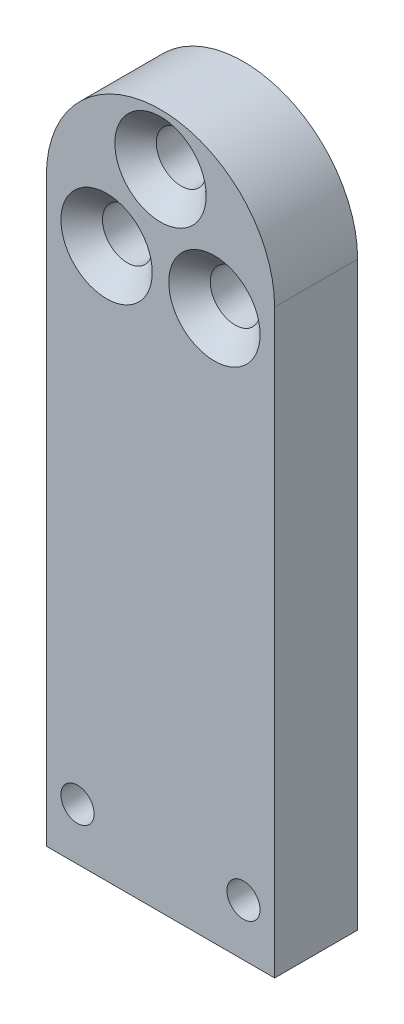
from build123d import *

# Parameters (mm, degrees)
RESSALTO_EXTRUS_O1_DEPTH                             = 4
FURO_ROSCADO_DE_M21_D                                = 1.6
ESCAREADO_PARA_PARAFUSO_COM_CABE_A_ESCAR_D           = 2.4
ESCAREADO_PARA_PARAFUSO_COM_CABE_A_ESCAR_CSINK_D     = 4.4
ESCAREADO_PARA_PARAFUSO_COM_CABE_A_ESCAR_CSINK_ANGLE = 90
PADR_OCIRCULAR1_COUNT                                = 3


with BuildPart() as part:
    # Esbo_o1 → Ressalto-extrus_o1 (new body)
    with BuildSketch(Plane.XY):
        with BuildLine():
            Line((-5.5, 0), (-5.5, -28))
            Line((-5.5, -28), (5.5, -28))
            Line((5.5, -28), (5.5, 0))
            ThreePointArc((5.5, 0), (0, 5.5), (-5.5, 0))
        make_face()
    extrude(amount=RESSALTO_EXTRUS_O1_DEPTH)

    # Furo roscado de M21 (through all)
    with Locations(Plane(origin=(-4, -25.5, 4), x_dir=(1, 0, 0), z_dir=(0, 0, 1))):
        with Locations((0, 0), (8, 0)):
            Hole(FURO_ROSCADO_DE_M21_D / 2)

    # Escareado para parafuso com cabe_a escar (through all)
    with Locations(Plane(origin=(0, 3, 4), x_dir=(1, 0, 0), z_dir=(0, 0, 1))):
        with Locations((0, 0)):
            escareado_para_parafuso_com_cabe_a_escar = CounterSinkHole(ESCAREADO_PARA_PARAFUSO_COM_CABE_A_ESCAR_D / 2, ESCAREADO_PARA_PARAFUSO_COM_CABE_A_ESCAR_CSINK_D / 2, counter_sink_angle=ESCAREADO_PARA_PARAFUSO_COM_CABE_A_ESCAR_CSINK_ANGLE)

    # Padr_oCircular1: Escareado para parafuso com cabe_a escar ×3 about axis
    padr_ocircular1_axis = Axis((0, 0, 0), (0, 0, 1))
    for i in range(1, PADR_OCIRCULAR1_COUNT):
        add(escareado_para_parafuso_com_cabe_a_escar.rotate(padr_ocircular1_axis, i * 360 / PADR_OCIRCULAR1_COUNT), mode=Mode.SUBTRACT)


solid = part.part
